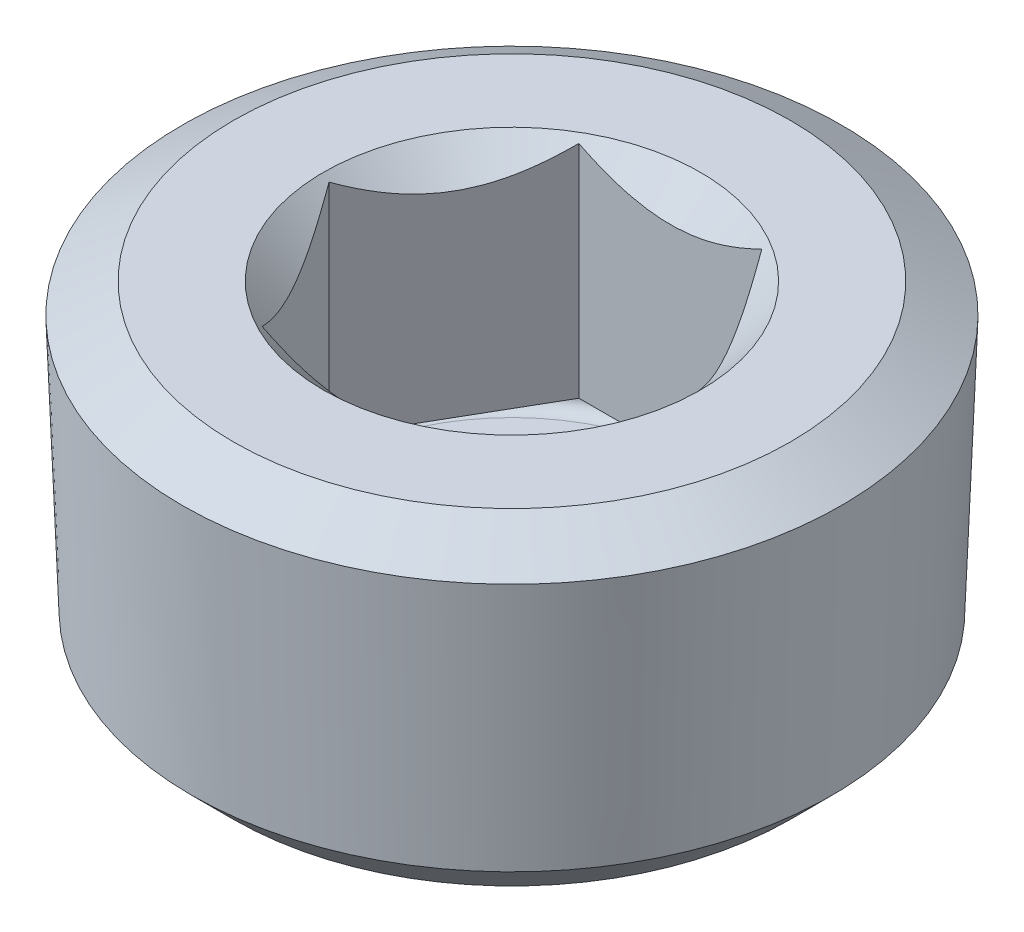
ISO-10303-21;
HEADER;
FILE_DESCRIPTION(('STEP AP214'),'2;1');
FILE_NAME('part.step','',(''),(''),'','','');
FILE_SCHEMA(('AUTOMOTIVE_DESIGN { 1 0 10303 214 1 1 1 1 }'));
ENDSEC;
DATA;
#1=APPLICATION_CONTEXT('core data for automotive mechanical design processes');
#2=APPLICATION_PROTOCOL_DEFINITION('international standard','automotive_design',2000,#1);
#3=PRODUCT_CONTEXT('',#1,'mechanical');
#4=PRODUCT('Part','Part','',(#3));
#5=PRODUCT_RELATED_PRODUCT_CATEGORY('part','',(#4));
#6=PRODUCT_DEFINITION_FORMATION('','',#4);
#7=PRODUCT_DEFINITION_CONTEXT('part definition',#1,'design');
#8=PRODUCT_DEFINITION('design','',#6,#7);
#9=PRODUCT_DEFINITION_SHAPE('','',#8);
#10=(LENGTH_UNIT() NAMED_UNIT(*) SI_UNIT(.MILLI.,.METRE.));
#11=(NAMED_UNIT(*) PLANE_ANGLE_UNIT() SI_UNIT($,.RADIAN.));
#12=(NAMED_UNIT(*) SI_UNIT($,.STERADIAN.) SOLID_ANGLE_UNIT());
#13=UNCERTAINTY_MEASURE_WITH_UNIT(LENGTH_MEASURE(1.E-05),#10,'distance_accuracy_value','');
#14=(GEOMETRIC_REPRESENTATION_CONTEXT(3) GLOBAL_UNCERTAINTY_ASSIGNED_CONTEXT((#13)) GLOBAL_UNIT_ASSIGNED_CONTEXT((#10,
#11,#12)) REPRESENTATION_CONTEXT('',''));
#15=CARTESIAN_POINT('',(0.,0.,0.));
#16=DIRECTION('',(0.,0.,1.));
#17=DIRECTION('',(1.,0.,0.));
#18=AXIS2_PLACEMENT_3D('',#15,#16,#17);
#19=CARTESIAN_POINT('',(0.,0.,0.));
#20=DIRECTION('',(0.,1.,0.));
#21=DIRECTION('',(0.,0.,1.));
#22=AXIS2_PLACEMENT_3D('',#19,#20,#21);
#23=PLANE('',#22);
#24=CARTESIAN_POINT('',(0.,0.,0.));
#25=DIRECTION('',(0.,1.,0.));
#26=DIRECTION('',(0.,0.,1.));
#27=AXIS2_PLACEMENT_3D('',#24,#25,#26);
#28=CIRCLE('',#27,9.525);
#29=CARTESIAN_POINT('',(0.,0.,9.525));
#30=VERTEX_POINT('',#29);
#31=EDGE_CURVE('E203',#30,#30,#28,.T.);
#32=ORIENTED_EDGE('',*,*,#31,.F.);
#33=EDGE_LOOP('',(#32));
#34=FACE_BOUND('',#33,.T.);
#35=CARTESIAN_POINT('',(0.,0.,0.));
#36=DIRECTION('',(0.,1.,0.));
#37=DIRECTION('',(0.,0.,1.));
#38=AXIS2_PLACEMENT_3D('',#35,#36,#37);
#39=CIRCLE('',#38,14.0665682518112);
#40=CARTESIAN_POINT('',(0.,0.,14.0665682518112));
#41=VERTEX_POINT('',#40);
#42=EDGE_CURVE('E95',#41,#41,#39,.T.);
#43=ORIENTED_EDGE('',*,*,#42,.T.);
#44=EDGE_LOOP('',(#43));
#45=FACE_BOUND('',#44,.T.);
#46=ADVANCED_FACE('F33',(#34,#45),#23,.T.);
#47=CARTESIAN_POINT('',(0.,0.,0.));
#48=DIRECTION('',(0.,-1.,0.));
#49=DIRECTION('',(0.,0.,-1.));
#50=AXIS2_PLACEMENT_3D('',#47,#48,#49);
#51=CONICAL_SURFACE('',#50,14.0665682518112,1.0471975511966);
#52=CARTESIAN_POINT('',(0.,-1.48935126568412,0.));
#53=DIRECTION('',(0.,1.,0.));
#54=DIRECTION('',(0.,0.,1.));
#55=AXIS2_PLACEMENT_3D('',#52,#53,#54);
#56=CIRCLE('',#55,16.6462003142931);
#57=CARTESIAN_POINT('',(0.,-1.48935126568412,16.6462003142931));
#58=VERTEX_POINT('',#57);
#59=EDGE_CURVE('E207',#58,#58,#56,.T.);
#60=ORIENTED_EDGE('',*,*,#59,.T.);
#61=EDGE_LOOP('',(#60));
#62=FACE_BOUND('',#61,.T.);
#63=ORIENTED_EDGE('',*,*,#42,.F.);
#64=EDGE_LOOP('',(#63));
#65=FACE_BOUND('',#64,.T.);
#66=ADVANCED_FACE('F193',(#62,#65),#51,.T.);
#67=CARTESIAN_POINT('',(0.,-1.48935126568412,0.));
#68=DIRECTION('',(0.,1.,0.));
#69=DIRECTION('',(0.,0.,1.));
#70=AXIS2_PLACEMENT_3D('',#67,#68,#69);
#71=CONICAL_SURFACE('',#70,16.6462003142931,0.0364424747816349);
#72=CARTESIAN_POINT('',(0.,-14.4011128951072,0.));
#73=DIRECTION('',(0.,1.,0.));
#74=DIRECTION('',(0.,0.,1.));
#75=AXIS2_PLACEMENT_3D('',#72,#73,#74);
#76=CIRCLE('',#75,16.1754553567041);
#77=CARTESIAN_POINT('',(0.,-14.4011128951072,16.1754553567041));
#78=VERTEX_POINT('',#77);
#79=EDGE_CURVE('E210',#78,#78,#76,.T.);
#80=ORIENTED_EDGE('',*,*,#79,.T.);
#81=EDGE_LOOP('',(#80));
#82=FACE_BOUND('',#81,.T.);
#83=ORIENTED_EDGE('',*,*,#59,.F.);
#84=EDGE_LOOP('',(#83));
#85=FACE_BOUND('',#84,.T.);
#86=ADVANCED_FACE('F198',(#82,#85),#71,.T.);
#87=CARTESIAN_POINT('',(0.,-14.4011128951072,0.));
#88=DIRECTION('',(0.,1.,0.));
#89=DIRECTION('',(0.,0.,1.));
#90=AXIS2_PLACEMENT_3D('',#87,#88,#89);
#91=CONICAL_SURFACE('',#90,16.1754553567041,0.785398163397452);
#92=CARTESIAN_POINT('',(0.,-16.51,0.));
#93=DIRECTION('',(0.,1.,0.));
#94=DIRECTION('',(0.,0.,1.));
#95=AXIS2_PLACEMENT_3D('',#92,#93,#94);
#96=CIRCLE('',#95,14.0665682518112);
#97=CARTESIAN_POINT('',(0.,-16.51,14.0665682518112));
#98=VERTEX_POINT('',#97);
#99=EDGE_CURVE('E215',#98,#98,#96,.T.);
#100=ORIENTED_EDGE('',*,*,#99,.T.);
#101=EDGE_LOOP('',(#100));
#102=FACE_BOUND('',#101,.T.);
#103=ORIENTED_EDGE('',*,*,#79,.F.);
#104=EDGE_LOOP('',(#103));
#105=FACE_BOUND('',#104,.T.);
#106=ADVANCED_FACE('F298',(#102,#105),#91,.T.);
#107=CARTESIAN_POINT('',(-14.0665682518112,-16.51,0.));
#108=DIRECTION('',(0.,-1.,0.));
#109=DIRECTION('',(0.,0.,-1.));
#110=AXIS2_PLACEMENT_3D('',#107,#108,#109);
#111=PLANE('',#110);
#112=ORIENTED_EDGE('',*,*,#99,.F.);
#113=EDGE_LOOP('',(#112));
#114=FACE_BOUND('',#113,.T.);
#115=ADVANCED_FACE('F146',(#114),#111,.T.);
#116=CARTESIAN_POINT('',(0.,0.,0.));
#117=DIRECTION('',(0.,1.,0.));
#118=DIRECTION('',(0.,0.,1.));
#119=AXIS2_PLACEMENT_3D('',#116,#117,#118);
#120=CONICAL_SURFACE('',#119,9.525,0.785398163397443);
#121=CARTESIAN_POINT('',(-9.75620633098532,3.09243091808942,8.001));
#122=CARTESIAN_POINT('',(-9.52094099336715,2.91055682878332,8.001));
#123=CARTESIAN_POINT('',(-9.28442126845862,2.73028010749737,8.001));
#124=CARTESIAN_POINT('',(-8.80835565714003,2.37365499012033,8.001));
#125=CARTESIAN_POINT('',(-8.56880907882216,2.19730751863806,8.001));
#126=CARTESIAN_POINT('',(-8.0844234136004,1.8480200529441,8.001));
#127=CARTESIAN_POINT('',(-7.83955777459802,1.67511676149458,8.001));
#128=CARTESIAN_POINT('',(-7.34577433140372,1.33521676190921,8.001));
#129=CARTESIAN_POINT('',(-7.0968568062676,1.16821964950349,8.001));
#130=CARTESIAN_POINT('',(-6.57791291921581,0.830846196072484,8.001));
#131=CARTESIAN_POINT('',(-6.30756757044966,0.660958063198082,8.001));
#132=CARTESIAN_POINT('',(-5.76052121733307,0.331566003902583,8.001));
#133=CARTESIAN_POINT('',(-5.4838191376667,0.172063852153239,8.001));
#134=CARTESIAN_POINT('',(-4.92395672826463,-0.133171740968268,8.001));
#135=CARTESIAN_POINT('',(-4.64081858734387,-0.278945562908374,8.001));
#136=CARTESIAN_POINT('',(-4.06646640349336,-0.553458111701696,8.001));
#137=CARTESIAN_POINT('',(-3.77525629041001,-0.682204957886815,8.001));
#138=CARTESIAN_POINT('',(-3.21459014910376,-0.905803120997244,8.001));
#139=CARTESIAN_POINT('',(-2.94599103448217,-1.00278136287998,8.001));
#140=CARTESIAN_POINT('',(-2.40185059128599,-1.17524738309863,8.001));
#141=CARTESIAN_POINT('',(-2.12630883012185,-1.25073381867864,8.001));
#142=CARTESIAN_POINT('',(-1.57478797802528,-1.37483041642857,8.001));
#143=CARTESIAN_POINT('',(-1.29892235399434,-1.42393631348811,8.001));
#144=CARTESIAN_POINT('',(-0.743636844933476,-1.49423018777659,8.001));
#145=CARTESIAN_POINT('',(-0.46421774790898,-1.51542424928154,8.001));
#146=CARTESIAN_POINT('',(0.0824654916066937,-1.52802781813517,8.001));
#147=CARTESIAN_POINT('',(0.349699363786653,-1.5207587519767,8.001));
#148=CARTESIAN_POINT('',(0.88213316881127,-1.47989810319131,8.001));
#149=CARTESIAN_POINT('',(1.14733291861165,-1.44630417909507,8.001));
#150=CARTESIAN_POINT('',(1.67827793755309,-1.35414026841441,8.001));
#151=CARTESIAN_POINT('',(1.94394456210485,-1.29512495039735,8.001));
#152=CARTESIAN_POINT('',(2.46940811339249,-1.15542669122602,8.001));
#153=CARTESIAN_POINT('',(2.72920532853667,-1.07474481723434,8.001));
#154=CARTESIAN_POINT('',(3.25501235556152,-0.890913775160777,8.001));
#155=CARTESIAN_POINT('',(3.52070069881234,-0.786855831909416,8.001));
#156=CARTESIAN_POINT('',(4.04525678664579,-0.562643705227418,8.001));
#157=CARTESIAN_POINT('',(4.30412141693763,-0.442482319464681,8.001));
#158=CARTESIAN_POINT('',(4.81624343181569,-0.188911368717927,8.001));
#159=CARTESIAN_POINT('',(5.06948054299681,-0.0554611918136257,8.001));
#160=CARTESIAN_POINT('',(5.57015704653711,0.221753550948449,8.001));
#161=CARTESIAN_POINT('',(5.81759731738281,0.365516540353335,8.001));
#162=CARTESIAN_POINT('',(6.29535628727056,0.654051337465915,8.001));
#163=CARTESIAN_POINT('',(6.52591752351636,0.798423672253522,8.001));
#164=CARTESIAN_POINT('',(6.98307831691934,1.09332822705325,8.001));
#165=CARTESIAN_POINT('',(7.20967757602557,1.24386090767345,8.001));
#166=CARTESIAN_POINT('',(7.65761461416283,1.5487666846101,8.001));
#167=CARTESIAN_POINT('',(7.87897999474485,1.7030993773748,8.001));
#168=CARTESIAN_POINT('',(8.31867170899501,2.01591299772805,8.001));
#169=CARTESIAN_POINT('',(8.53699886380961,2.17439276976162,8.001));
#170=CARTESIAN_POINT('',(8.75405107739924,2.33457045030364,8.001));
#171=B_SPLINE_CURVE_WITH_KNOTS('',3,(#121,#122,#123,#124,#125,#126,#127,#128,#129,#130,#131,
#132,#133,#134,#135,#136,#137,#138,#139,#140,#141,#142,#143,#144,#145,#146,#147,#148,#149,#150,
#151,#152,#153,#154,#155,#156,#157,#158,#159,#160,#161,#162,#163,#164,#165,#166,#167,#168,#169,
#170),.UNSPECIFIED.,.F.,.F.,(4,2,2,2,2,2,2,2,2,2,2,2,2,2,2,2,2,2,2,2,2,2,2,2,4),(0.,
0.892121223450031,1.784450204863,2.68365151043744,3.58279114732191,4.54048731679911,
5.4983467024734,6.45329436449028,7.40778500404,8.26376032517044,9.11978911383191,
9.95911277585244,10.7982534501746,11.5989086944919,12.3996351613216,13.2149987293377,
14.030322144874,14.885685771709,15.7414332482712,16.5998812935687,17.4581983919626,
18.274182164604,19.0902270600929,19.8997375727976,20.7090248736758),.UNSPECIFIED.);
#172=CARTESIAN_POINT('',(4.6193795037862,-0.286240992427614,8.001));
#173=VERTEX_POINT('',#172);
#174=CARTESIAN_POINT('',(-4.61937950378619,-0.286240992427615,8.001));
#175=VERTEX_POINT('',#174);
#176=EDGE_CURVE('E47',#173,#175,#171,.F.);
#177=ORIENTED_EDGE('',*,*,#176,.T.);
#178=CARTESIAN_POINT('',(-4.61926403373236,-0.28612552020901,8.0012));
#179=CARTESIAN_POINT('',(-4.69869011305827,-0.365542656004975,7.86362999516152));
#180=CARTESIAN_POINT('',(-4.77872669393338,-0.442522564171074,7.72500257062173));
#181=CARTESIAN_POINT('',(-4.94014062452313,-0.590866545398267,7.44542544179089));
#182=CARTESIAN_POINT('',(-5.02151867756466,-0.662227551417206,7.30447451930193));
#183=CARTESIAN_POINT('',(-5.2686006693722,-0.867378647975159,6.87651595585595));
#184=CARTESIAN_POINT('',(-5.43639624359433,-0.991361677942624,6.58588549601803));
#185=CARTESIAN_POINT('',(-5.77476940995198,-1.20367390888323,5.99980597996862));
#186=CARTESIAN_POINT('',(-5.94526052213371,-1.29253797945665,5.70450671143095));
#187=CARTESIAN_POINT('',(-6.2038000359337,-1.39533175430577,5.25670313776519));
#188=CARTESIAN_POINT('',(-6.29036050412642,-1.42449887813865,5.10677600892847));
#189=CARTESIAN_POINT('',(-6.46421433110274,-1.47200567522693,4.80565234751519));
#190=CARTESIAN_POINT('',(-6.55150757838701,-1.49034696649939,4.65445600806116));
#191=CARTESIAN_POINT('',(-6.7642309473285,-1.52109895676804,4.28600832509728));
#192=CARTESIAN_POINT('',(-6.88989027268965,-1.52755109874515,4.06835998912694));
#193=CARTESIAN_POINT('',(-7.14098242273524,-1.51672016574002,3.63345562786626));
#194=CARTESIAN_POINT('',(-7.26641515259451,-1.49942877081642,3.41619976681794));
#195=CARTESIAN_POINT('',(-7.51609803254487,-1.44213002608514,2.98373633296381));
#196=CARTESIAN_POINT('',(-7.64034670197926,-1.40209727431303,2.76853132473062));
#197=CARTESIAN_POINT('',(-7.88670850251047,-1.30149224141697,2.34182016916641));
#198=CARTESIAN_POINT('',(-8.00882179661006,-1.24092153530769,2.13031373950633));
#199=CARTESIAN_POINT('',(-8.22559130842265,-1.11631110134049,1.75485793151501));
#200=CARTESIAN_POINT('',(-8.32072758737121,-1.05554902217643,1.59007706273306));
#201=CARTESIAN_POINT('',(-8.5092923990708,-0.924233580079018,1.26347322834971));
#202=CARTESIAN_POINT('',(-8.60272088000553,-0.853679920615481,1.10165035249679));
#203=CARTESIAN_POINT('',(-8.78757582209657,-0.704362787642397,0.781472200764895));
#204=CARTESIAN_POINT('',(-8.87900754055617,-0.62562513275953,0.623107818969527));
#205=CARTESIAN_POINT('',(-9.06017798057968,-0.460973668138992,0.309311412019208));
#206=CARTESIAN_POINT('',(-9.14991769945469,-0.375064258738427,0.153877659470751));
#207=CARTESIAN_POINT('',(-9.23887447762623,-0.28612552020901,-0.000199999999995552));
#208=B_SPLINE_CURVE_WITH_KNOTS('',3,(#178,#179,#180,#181,#182,#183,#184,#185,#186,#187,#188,
#189,#190,#191,#192,#193,#194,#195,#196,#197,#198,#199,#200,#201,#202,#203,#204,#205,#206,#207),
.UNSPECIFIED.,.F.,.F.,(4,2,2,2,2,2,2,2,2,2,2,2,2,2,4),(0.,0.532763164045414,1.06581514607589,
2.13767380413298,3.1925129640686,3.71889809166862,4.24520452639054,4.99823705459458,
5.75153351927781,6.5056730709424,7.25975480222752,7.8586907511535,8.45764484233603,
9.05476364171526,9.6515187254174),.UNSPECIFIED.);
#209=CARTESIAN_POINT('',(-9.23875900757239,-0.286240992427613,0.));
#210=VERTEX_POINT('',#209);
#211=EDGE_CURVE('E101',#175,#210,#208,.T.);
#212=ORIENTED_EDGE('',*,*,#211,.T.);
#213=CARTESIAN_POINT('',(-9.23887447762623,-0.28612552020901,0.000200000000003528));
#214=CARTESIAN_POINT('',(-9.15944839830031,-0.365542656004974,-0.137370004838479));
#215=CARTESIAN_POINT('',(-9.0794118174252,-0.442522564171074,-0.275997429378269));
#216=CARTESIAN_POINT('',(-8.91799788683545,-0.590866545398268,-0.555574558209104));
#217=CARTESIAN_POINT('',(-8.83661983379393,-0.662227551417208,-0.696525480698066));
#218=CARTESIAN_POINT('',(-8.58953784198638,-0.867378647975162,-1.12448404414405));
#219=CARTESIAN_POINT('',(-8.42174226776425,-0.991361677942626,-1.41511450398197));
#220=CARTESIAN_POINT('',(-8.0833691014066,-1.20367390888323,-2.00119402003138));
#221=CARTESIAN_POINT('',(-7.91287798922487,-1.29253797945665,-2.29649328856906));
#222=CARTESIAN_POINT('',(-7.65433847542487,-1.39533175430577,-2.74429686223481));
#223=CARTESIAN_POINT('',(-7.56777800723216,-1.42449887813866,-2.89422399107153));
#224=CARTESIAN_POINT('',(-7.39392418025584,-1.47200567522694,-3.19534765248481));
#225=CARTESIAN_POINT('',(-7.30663093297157,-1.4903469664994,-3.34654399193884));
#226=CARTESIAN_POINT('',(-7.09390756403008,-1.52109895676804,-3.71499167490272));
#227=CARTESIAN_POINT('',(-6.96824823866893,-1.52755109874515,-3.93264001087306));
#228=CARTESIAN_POINT('',(-6.71715608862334,-1.51672016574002,-4.36754437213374));
#229=CARTESIAN_POINT('',(-6.59172335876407,-1.49942877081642,-4.58480023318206));
#230=CARTESIAN_POINT('',(-6.34204047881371,-1.44213002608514,-5.01726366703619));
#231=CARTESIAN_POINT('',(-6.21779180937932,-1.40209727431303,-5.23246867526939));
#232=CARTESIAN_POINT('',(-5.97143000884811,-1.30149224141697,-5.6591798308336));
#233=CARTESIAN_POINT('',(-5.84931671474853,-1.24092153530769,-5.87068626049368));
#234=CARTESIAN_POINT('',(-5.63254720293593,-1.11631110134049,-6.246142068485));
#235=CARTESIAN_POINT('',(-5.53741092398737,-1.05554902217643,-6.41092293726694));
#236=CARTESIAN_POINT('',(-5.34884611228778,-0.924233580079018,-6.73752677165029));
#237=CARTESIAN_POINT('',(-5.25541763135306,-0.853679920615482,-6.89934964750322));
#238=CARTESIAN_POINT('',(-5.07056268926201,-0.704362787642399,-7.21952779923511));
#239=CARTESIAN_POINT('',(-4.97913097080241,-0.625625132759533,-7.37789218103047));
#240=CARTESIAN_POINT('',(-4.7979605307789,-0.460973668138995,-7.69168858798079));
#241=CARTESIAN_POINT('',(-4.7082208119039,-0.37506425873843,-7.84712234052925));
#242=CARTESIAN_POINT('',(-4.61926403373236,-0.286125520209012,-8.0012));
#243=B_SPLINE_CURVE_WITH_KNOTS('',3,(#213,#214,#215,#216,#217,#218,#219,#220,#221,#222,#223,
#224,#225,#226,#227,#228,#229,#230,#231,#232,#233,#234,#235,#236,#237,#238,#239,#240,#241,#242),
.UNSPECIFIED.,.F.,.F.,(4,2,2,2,2,2,2,2,2,2,2,2,2,2,4),(0.,0.532763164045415,1.06581514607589,
2.13767380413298,3.19251296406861,3.71889809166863,4.24520452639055,4.99823705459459,
5.75153351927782,6.50567307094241,7.25975480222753,7.85869075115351,8.45764484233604,
9.05476364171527,9.65151872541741),.UNSPECIFIED.);
#244=CARTESIAN_POINT('',(-4.6193795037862,-0.286240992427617,-8.00099999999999));
#245=VERTEX_POINT('',#244);
#246=EDGE_CURVE('E167',#210,#245,#243,.T.);
#247=ORIENTED_EDGE('',*,*,#246,.T.);
#248=CARTESIAN_POINT('',(-9.75620633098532,3.09243091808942,-8.00099999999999));
#249=CARTESIAN_POINT('',(-9.52094099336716,2.91055682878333,-8.00099999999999));
#250=CARTESIAN_POINT('',(-9.28442126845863,2.73028010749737,-8.00099999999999));
#251=CARTESIAN_POINT('',(-8.80835565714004,2.37365499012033,-8.00099999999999));
#252=CARTESIAN_POINT('',(-8.56880907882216,2.19730751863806,-8.00099999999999));
#253=CARTESIAN_POINT('',(-8.08442341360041,1.8480200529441,-8.00099999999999));
#254=CARTESIAN_POINT('',(-7.83955777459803,1.67511676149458,-8.00099999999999));
#255=CARTESIAN_POINT('',(-7.34577433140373,1.33521676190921,-8.00099999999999));
#256=CARTESIAN_POINT('',(-7.0968568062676,1.16821964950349,-8.00099999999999));
#257=CARTESIAN_POINT('',(-6.57791291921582,0.830846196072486,-8.00099999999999));
#258=CARTESIAN_POINT('',(-6.30756757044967,0.660958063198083,-8.00099999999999));
#259=CARTESIAN_POINT('',(-5.76052121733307,0.331566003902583,-8.00099999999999));
#260=CARTESIAN_POINT('',(-5.4838191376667,0.172063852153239,-8.00099999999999));
#261=CARTESIAN_POINT('',(-4.92395672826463,-0.133171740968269,-8.00099999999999));
#262=CARTESIAN_POINT('',(-4.64081858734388,-0.278945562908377,-8.00099999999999));
#263=CARTESIAN_POINT('',(-4.06646640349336,-0.5534581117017,-8.00099999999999));
#264=CARTESIAN_POINT('',(-3.77525629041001,-0.682204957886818,-8.00099999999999));
#265=CARTESIAN_POINT('',(-3.21459014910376,-0.905803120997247,-8.00099999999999));
#266=CARTESIAN_POINT('',(-2.94599103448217,-1.00278136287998,-8.00099999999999));
#267=CARTESIAN_POINT('',(-2.40185059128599,-1.17524738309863,-8.00099999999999));
#268=CARTESIAN_POINT('',(-2.12630883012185,-1.25073381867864,-8.00099999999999));
#269=CARTESIAN_POINT('',(-1.57478797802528,-1.37483041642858,-8.00099999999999));
#270=CARTESIAN_POINT('',(-1.29892235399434,-1.42393631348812,-8.00099999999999));
#271=CARTESIAN_POINT('',(-0.743636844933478,-1.49423018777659,-8.00099999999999));
#272=CARTESIAN_POINT('',(-0.464217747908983,-1.51542424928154,-8.00099999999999));
#273=CARTESIAN_POINT('',(0.0824654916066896,-1.52802781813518,-8.00099999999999));
#274=CARTESIAN_POINT('',(0.349699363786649,-1.5207587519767,-8.00099999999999));
#275=CARTESIAN_POINT('',(0.882133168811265,-1.47989810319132,-8.00099999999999));
#276=CARTESIAN_POINT('',(1.14733291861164,-1.44630417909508,-8.00099999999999));
#277=CARTESIAN_POINT('',(1.67827793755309,-1.35414026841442,-8.00099999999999));
#278=CARTESIAN_POINT('',(1.94394456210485,-1.29512495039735,-8.00099999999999));
#279=CARTESIAN_POINT('',(2.46940811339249,-1.15542669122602,-8.00099999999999));
#280=CARTESIAN_POINT('',(2.72920532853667,-1.07474481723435,-8.00099999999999));
#281=CARTESIAN_POINT('',(3.25501235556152,-0.89091377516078,-8.00099999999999));
#282=CARTESIAN_POINT('',(3.52070069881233,-0.78685583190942,-8.00099999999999));
#283=CARTESIAN_POINT('',(4.04525678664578,-0.562643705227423,-8.00099999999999));
#284=CARTESIAN_POINT('',(4.30412141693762,-0.442482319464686,-8.00099999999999));
#285=CARTESIAN_POINT('',(4.81624343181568,-0.188911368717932,-8.00099999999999));
#286=CARTESIAN_POINT('',(5.06948054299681,-0.0554611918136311,-8.00099999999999));
#287=CARTESIAN_POINT('',(5.5701570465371,0.221753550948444,-8.00099999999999));
#288=CARTESIAN_POINT('',(5.81759731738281,0.365516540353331,-8.00099999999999));
#289=CARTESIAN_POINT('',(6.29535628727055,0.654051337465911,-8.00099999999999));
#290=CARTESIAN_POINT('',(6.52591752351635,0.798423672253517,-8.00099999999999));
#291=CARTESIAN_POINT('',(6.98307831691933,1.09332822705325,-8.00099999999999));
#292=CARTESIAN_POINT('',(7.20967757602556,1.24386090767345,-8.00099999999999));
#293=CARTESIAN_POINT('',(7.65761461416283,1.5487666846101,-8.00099999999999));
#294=CARTESIAN_POINT('',(7.87897999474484,1.70309937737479,-8.00099999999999));
#295=CARTESIAN_POINT('',(8.31867170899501,2.01591299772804,-8.00099999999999));
#296=CARTESIAN_POINT('',(8.5369988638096,2.17439276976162,-8.00099999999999));
#297=CARTESIAN_POINT('',(8.75405107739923,2.33457045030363,-8.00099999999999));
#298=B_SPLINE_CURVE_WITH_KNOTS('',3,(#248,#249,#250,#251,#252,#253,#254,#255,#256,#257,#258,
#259,#260,#261,#262,#263,#264,#265,#266,#267,#268,#269,#270,#271,#272,#273,#274,#275,#276,#277,
#278,#279,#280,#281,#282,#283,#284,#285,#286,#287,#288,#289,#290,#291,#292,#293,#294,#295,#296,
#297),.UNSPECIFIED.,.F.,.F.,(4,2,2,2,2,2,2,2,2,2,2,2,2,2,2,2,2,2,2,2,2,2,2,2,4),(0.,
0.892121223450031,1.784450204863,2.68365151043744,3.58279114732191,4.54048731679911,
5.49834670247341,6.45329436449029,7.40778500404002,8.26376032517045,9.11978911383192,
9.95911277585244,10.7982534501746,11.5989086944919,12.3996351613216,13.2149987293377,
14.030322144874,14.885685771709,15.7414332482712,16.5998812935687,17.4581983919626,
18.274182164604,19.0902270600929,19.8997375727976,20.7090248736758),.UNSPECIFIED.);
#299=CARTESIAN_POINT('',(4.61937950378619,-0.286240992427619,-8.00099999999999));
#300=VERTEX_POINT('',#299);
#301=EDGE_CURVE('E161',#245,#300,#298,.T.);
#302=ORIENTED_EDGE('',*,*,#301,.T.);
#303=CARTESIAN_POINT('',(4.61926403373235,-0.286125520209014,-8.0012));
#304=CARTESIAN_POINT('',(4.69869011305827,-0.365542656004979,-7.86362999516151));
#305=CARTESIAN_POINT('',(4.77872669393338,-0.442522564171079,-7.72500257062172));
#306=CARTESIAN_POINT('',(4.94014062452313,-0.590866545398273,-7.44542544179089));
#307=CARTESIAN_POINT('',(5.02151867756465,-0.662227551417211,-7.30447451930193));
#308=CARTESIAN_POINT('',(5.2686006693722,-0.867378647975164,-6.87651595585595));
#309=CARTESIAN_POINT('',(5.43639624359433,-0.991361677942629,-6.58588549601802));
#310=CARTESIAN_POINT('',(5.77476940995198,-1.20367390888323,-5.99980597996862));
#311=CARTESIAN_POINT('',(5.9452605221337,-1.29253797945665,-5.70450671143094));
#312=CARTESIAN_POINT('',(6.2038000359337,-1.39533175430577,-5.25670313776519));
#313=CARTESIAN_POINT('',(6.29036050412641,-1.42449887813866,-5.10677600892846));
#314=CARTESIAN_POINT('',(6.46421433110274,-1.47200567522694,-4.80565234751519));
#315=CARTESIAN_POINT('',(6.551507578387,-1.4903469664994,-4.65445600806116));
#316=CARTESIAN_POINT('',(6.76423094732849,-1.52109895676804,-4.28600832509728));
#317=CARTESIAN_POINT('',(6.88989027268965,-1.52755109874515,-4.06835998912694));
#318=CARTESIAN_POINT('',(7.14098242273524,-1.51672016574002,-3.63345562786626));
#319=CARTESIAN_POINT('',(7.26641515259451,-1.49942877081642,-3.41619976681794));
#320=CARTESIAN_POINT('',(7.51609803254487,-1.44213002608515,-2.98373633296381));
#321=CARTESIAN_POINT('',(7.64034670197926,-1.40209727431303,-2.76853132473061));
#322=CARTESIAN_POINT('',(7.88670850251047,-1.30149224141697,-2.3418201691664));
#323=CARTESIAN_POINT('',(8.00882179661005,-1.24092153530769,-2.13031373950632));
#324=CARTESIAN_POINT('',(8.22559130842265,-1.11631110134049,-1.75485793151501));
#325=CARTESIAN_POINT('',(8.32072758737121,-1.05554902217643,-1.59007706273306));
#326=CARTESIAN_POINT('',(8.5092923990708,-0.92423358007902,-1.26347322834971));
#327=CARTESIAN_POINT('',(8.60272088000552,-0.853679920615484,-1.10165035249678));
#328=CARTESIAN_POINT('',(8.78757582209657,-0.704362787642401,-0.781472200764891));
#329=CARTESIAN_POINT('',(8.87900754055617,-0.625625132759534,-0.623107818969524));
#330=CARTESIAN_POINT('',(9.06017798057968,-0.460973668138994,-0.309311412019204));
#331=CARTESIAN_POINT('',(9.14991769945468,-0.375064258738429,-0.153877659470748));
#332=CARTESIAN_POINT('',(9.23887447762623,-0.28612552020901,0.000199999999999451));
#333=B_SPLINE_CURVE_WITH_KNOTS('',3,(#303,#304,#305,#306,#307,#308,#309,#310,#311,#312,#313,
#314,#315,#316,#317,#318,#319,#320,#321,#322,#323,#324,#325,#326,#327,#328,#329,#330,#331,#332),
.UNSPECIFIED.,.F.,.F.,(4,2,2,2,2,2,2,2,2,2,2,2,2,2,4),(0.,0.532763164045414,1.06581514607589,
2.13767380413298,3.19251296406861,3.71889809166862,4.24520452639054,4.99823705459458,
5.75153351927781,6.5056730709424,7.25975480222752,7.8586907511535,8.45764484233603,
9.05476364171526,9.6515187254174),.UNSPECIFIED.);
#334=CARTESIAN_POINT('',(9.23875900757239,-0.286240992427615,0.));
#335=VERTEX_POINT('',#334);
#336=EDGE_CURVE('E155',#300,#335,#333,.T.);
#337=ORIENTED_EDGE('',*,*,#336,.T.);
#338=CARTESIAN_POINT('',(9.23887447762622,-0.286125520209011,-0.000200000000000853));
#339=CARTESIAN_POINT('',(9.15944839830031,-0.365542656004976,0.137370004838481));
#340=CARTESIAN_POINT('',(9.0794118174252,-0.442522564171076,0.275997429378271));
#341=CARTESIAN_POINT('',(8.91799788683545,-0.59086654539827,0.555574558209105));
#342=CARTESIAN_POINT('',(8.83661983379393,-0.662227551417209,0.696525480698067));
#343=CARTESIAN_POINT('',(8.58953784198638,-0.867378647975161,1.12448404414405));
#344=CARTESIAN_POINT('',(8.42174226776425,-0.991361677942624,1.41511450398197));
#345=CARTESIAN_POINT('',(8.0833691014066,-1.20367390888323,2.00119402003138));
#346=CARTESIAN_POINT('',(7.91287798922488,-1.29253797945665,2.29649328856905));
#347=CARTESIAN_POINT('',(7.65433847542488,-1.39533175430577,2.7442968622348));
#348=CARTESIAN_POINT('',(7.56777800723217,-1.42449887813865,2.89422399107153));
#349=CARTESIAN_POINT('',(7.39392418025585,-1.47200567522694,3.19534765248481));
#350=CARTESIAN_POINT('',(7.30663093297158,-1.49034696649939,3.34654399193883));
#351=CARTESIAN_POINT('',(7.09390756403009,-1.52109895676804,3.71499167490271));
#352=CARTESIAN_POINT('',(6.96824823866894,-1.52755109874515,3.93264001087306));
#353=CARTESIAN_POINT('',(6.71715608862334,-1.51672016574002,4.36754437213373));
#354=CARTESIAN_POINT('',(6.59172335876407,-1.49942877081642,4.58480023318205));
#355=CARTESIAN_POINT('',(6.34204047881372,-1.44213002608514,5.01726366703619));
#356=CARTESIAN_POINT('',(6.21779180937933,-1.40209727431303,5.23246867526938));
#357=CARTESIAN_POINT('',(5.97143000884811,-1.30149224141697,5.65917983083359));
#358=CARTESIAN_POINT('',(5.84931671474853,-1.24092153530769,5.87068626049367));
#359=CARTESIAN_POINT('',(5.63254720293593,-1.11631110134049,6.24614206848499));
#360=CARTESIAN_POINT('',(5.53741092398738,-1.05554902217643,6.41092293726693));
#361=CARTESIAN_POINT('',(5.34884611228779,-0.924233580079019,6.73752677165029));
#362=CARTESIAN_POINT('',(5.25541763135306,-0.853679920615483,6.89934964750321));
#363=CARTESIAN_POINT('',(5.07056268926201,-0.704362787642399,7.21952779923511));
#364=CARTESIAN_POINT('',(4.97913097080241,-0.625625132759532,7.37789218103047));
#365=CARTESIAN_POINT('',(4.79796053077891,-0.460973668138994,7.69168858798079));
#366=CARTESIAN_POINT('',(4.7082208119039,-0.375064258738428,7.84712234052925));
#367=CARTESIAN_POINT('',(4.61926403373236,-0.28612552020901,8.0012));
#368=B_SPLINE_CURVE_WITH_KNOTS('',3,(#338,#339,#340,#341,#342,#343,#344,#345,#346,#347,#348,
#349,#350,#351,#352,#353,#354,#355,#356,#357,#358,#359,#360,#361,#362,#363,#364,#365,#366,#367),
.UNSPECIFIED.,.F.,.F.,(4,2,2,2,2,2,2,2,2,2,2,2,2,2,4),(0.,0.532763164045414,1.06581514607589,
2.13767380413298,3.1925129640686,3.71889809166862,4.24520452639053,4.99823705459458,
5.75153351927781,6.5056730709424,7.25975480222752,7.8586907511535,8.45764484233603,
9.05476364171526,9.65151872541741),.UNSPECIFIED.);
#369=EDGE_CURVE('E120',#335,#173,#368,.T.);
#370=ORIENTED_EDGE('',*,*,#369,.T.);
#371=EDGE_LOOP('',(#177,#212,#247,#302,#337,#370));
#372=FACE_BOUND('',#371,.T.);
#373=ORIENTED_EDGE('',*,*,#31,.T.);
#374=EDGE_LOOP('',(#373));
#375=FACE_BOUND('',#374,.T.);
#376=ADVANCED_FACE('F141',(#372,#375),#120,.F.);
#377=CARTESIAN_POINT('',(-9.23875900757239,-11.43,0.));
#378=DIRECTION('',(-0.866025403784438,0.,0.5));
#379=DIRECTION('',(0.5,0.,0.866025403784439));
#380=AXIS2_PLACEMENT_3D('',#377,#378,#379);
#381=PLANE('',#380);
#382=DIRECTION('',(0.,1.,0.));
#383=VECTOR('',#382,1.);
#384=CARTESIAN_POINT('',(-4.61937950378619,-11.43,8.001));
#385=LINE('',#384,#383);
#386=CARTESIAN_POINT('',(-4.61937950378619,-11.43,8.001));
#387=VERTEX_POINT('',#386);
#388=EDGE_CURVE('E89',#387,#175,#385,.T.);
#389=ORIENTED_EDGE('',*,*,#388,.F.);
#390=DIRECTION('',(0.5,0.,0.866025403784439));
#391=VECTOR('',#390,1.);
#392=CARTESIAN_POINT('',(-8.92931925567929,-11.43,0.535965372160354));
#393=LINE('',#392,#391);
#394=CARTESIAN_POINT('',(-9.23875900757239,-11.43,0.));
#395=VERTEX_POINT('',#394);
#396=EDGE_CURVE('E94',#395,#387,#393,.T.);
#397=ORIENTED_EDGE('',*,*,#396,.F.);
#398=DIRECTION('',(0.,1.,0.));
#399=VECTOR('',#398,1.);
#400=CARTESIAN_POINT('',(-9.23875900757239,-11.43,0.));
#401=LINE('',#400,#399);
#402=EDGE_CURVE('E133',#395,#210,#401,.T.);
#403=ORIENTED_EDGE('',*,*,#402,.T.);
#404=ORIENTED_EDGE('',*,*,#211,.F.);
#405=EDGE_LOOP('',(#389,#397,#403,#404));
#406=FACE_BOUND('',#405,.T.);
#407=ADVANCED_FACE('F98',(#406),#381,.F.);
#408=CARTESIAN_POINT('',(-4.6193795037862,-11.43,-8.00099999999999));
#409=DIRECTION('',(-0.866025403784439,0.,-0.5));
#410=DIRECTION('',(-0.5,0.,0.866025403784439));
#411=AXIS2_PLACEMENT_3D('',#408,#409,#410);
#412=PLANE('',#411);
#413=ORIENTED_EDGE('',*,*,#402,.F.);
#414=DIRECTION('',(-0.5,0.,0.866025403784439));
#415=VECTOR('',#414,1.);
#416=CARTESIAN_POINT('',(-8.92931925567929,-11.43,-0.535965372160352));
#417=LINE('',#416,#415);
#418=CARTESIAN_POINT('',(-4.6193795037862,-11.43,-8.00099999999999));
#419=VERTEX_POINT('',#418);
#420=EDGE_CURVE('E106',#419,#395,#417,.T.);
#421=ORIENTED_EDGE('',*,*,#420,.F.);
#422=DIRECTION('',(0.,1.,0.));
#423=VECTOR('',#422,1.);
#424=CARTESIAN_POINT('',(-4.6193795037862,-11.43,-8.00099999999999));
#425=LINE('',#424,#423);
#426=EDGE_CURVE('E122',#419,#245,#425,.T.);
#427=ORIENTED_EDGE('',*,*,#426,.T.);
#428=ORIENTED_EDGE('',*,*,#246,.F.);
#429=EDGE_LOOP('',(#413,#421,#427,#428));
#430=FACE_BOUND('',#429,.T.);
#431=ADVANCED_FACE('F176',(#430),#412,.F.);
#432=CARTESIAN_POINT('',(4.61937950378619,-11.43,-8.00099999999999));
#433=DIRECTION('',(0.,0.,-1.));
#434=DIRECTION('',(-1.,0.,0.));
#435=AXIS2_PLACEMENT_3D('',#432,#433,#434);
#436=PLANE('',#435);
#437=ORIENTED_EDGE('',*,*,#426,.F.);
#438=DIRECTION('',(-1.,0.,0.));
#439=VECTOR('',#438,1.);
#440=CARTESIAN_POINT('',(-8.001,-11.43,-8.00099999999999));
#441=LINE('',#440,#439);
#442=CARTESIAN_POINT('',(4.61937950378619,-11.43,-8.00099999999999));
#443=VERTEX_POINT('',#442);
#444=EDGE_CURVE('E12',#443,#419,#441,.T.);
#445=ORIENTED_EDGE('',*,*,#444,.F.);
#446=DIRECTION('',(0.,1.,0.));
#447=VECTOR('',#446,1.);
#448=CARTESIAN_POINT('',(4.61937950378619,-11.43,-8.00099999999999));
#449=LINE('',#448,#447);
#450=EDGE_CURVE('E117',#443,#300,#449,.T.);
#451=ORIENTED_EDGE('',*,*,#450,.T.);
#452=ORIENTED_EDGE('',*,*,#301,.F.);
#453=EDGE_LOOP('',(#437,#445,#451,#452));
#454=FACE_BOUND('',#453,.T.);
#455=ADVANCED_FACE('F179',(#454),#436,.F.);
#456=CARTESIAN_POINT('',(9.23875900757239,-11.43,0.));
#457=DIRECTION('',(0.866025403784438,0.,-0.5));
#458=DIRECTION('',(-0.5,0.,-0.866025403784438));
#459=AXIS2_PLACEMENT_3D('',#456,#457,#458);
#460=PLANE('',#459);
#461=ORIENTED_EDGE('',*,*,#450,.F.);
#462=DIRECTION('',(-0.5,0.,-0.866025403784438));
#463=VECTOR('',#462,1.);
#464=CARTESIAN_POINT('',(4.92881925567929,-11.43,-7.46503462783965));
#465=LINE('',#464,#463);
#466=CARTESIAN_POINT('',(9.23875900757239,-11.43,0.));
#467=VERTEX_POINT('',#466);
#468=EDGE_CURVE('E40',#467,#443,#465,.T.);
#469=ORIENTED_EDGE('',*,*,#468,.F.);
#470=DIRECTION('',(0.,1.,0.));
#471=VECTOR('',#470,1.);
#472=CARTESIAN_POINT('',(9.23875900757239,-11.43,0.));
#473=LINE('',#472,#471);
#474=EDGE_CURVE('E115',#467,#335,#473,.T.);
#475=ORIENTED_EDGE('',*,*,#474,.T.);
#476=ORIENTED_EDGE('',*,*,#336,.F.);
#477=EDGE_LOOP('',(#461,#469,#475,#476));
#478=FACE_BOUND('',#477,.T.);
#479=ADVANCED_FACE('F113',(#478),#460,.F.);
#480=CARTESIAN_POINT('',(4.6193795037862,-11.43,8.001));
#481=DIRECTION('',(0.866025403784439,0.,0.5));
#482=DIRECTION('',(0.5,0.,-0.866025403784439));
#483=AXIS2_PLACEMENT_3D('',#480,#481,#482);
#484=PLANE('',#483);
#485=ORIENTED_EDGE('',*,*,#474,.F.);
#486=DIRECTION('',(0.5,0.,-0.866025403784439));
#487=VECTOR('',#486,1.);
#488=CARTESIAN_POINT('',(4.92881925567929,-11.43,7.46503462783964));
#489=LINE('',#488,#487);
#490=CARTESIAN_POINT('',(4.6193795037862,-11.43,8.001));
#491=VERTEX_POINT('',#490);
#492=EDGE_CURVE('E55',#491,#467,#489,.T.);
#493=ORIENTED_EDGE('',*,*,#492,.F.);
#494=DIRECTION('',(0.,1.,0.));
#495=VECTOR('',#494,1.);
#496=CARTESIAN_POINT('',(4.6193795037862,-11.43,8.001));
#497=LINE('',#496,#495);
#498=EDGE_CURVE('E91',#491,#173,#497,.T.);
#499=ORIENTED_EDGE('',*,*,#498,.T.);
#500=ORIENTED_EDGE('',*,*,#369,.F.);
#501=EDGE_LOOP('',(#485,#493,#499,#500));
#502=FACE_BOUND('',#501,.T.);
#503=ADVANCED_FACE('F119',(#502),#484,.F.);
#504=CARTESIAN_POINT('',(-4.61937950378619,-11.43,8.001));
#505=DIRECTION('',(0.,0.,1.));
#506=DIRECTION('',(1.,0.,0.));
#507=AXIS2_PLACEMENT_3D('',#504,#505,#506);
#508=PLANE('',#507);
#509=ORIENTED_EDGE('',*,*,#498,.F.);
#510=DIRECTION('',(1.,0.,0.));
#511=VECTOR('',#510,1.);
#512=CARTESIAN_POINT('',(-8.001,-11.43,8.001));
#513=LINE('',#512,#511);
#514=EDGE_CURVE('E86',#387,#491,#513,.T.);
#515=ORIENTED_EDGE('',*,*,#514,.F.);
#516=ORIENTED_EDGE('',*,*,#388,.T.);
#517=ORIENTED_EDGE('',*,*,#176,.F.);
#518=EDGE_LOOP('',(#509,#515,#516,#517));
#519=FACE_BOUND('',#518,.T.);
#520=ADVANCED_FACE('F88',(#519),#508,.F.);
#521=CARTESIAN_POINT('',(-9.525,-12.7,0.));
#522=DIRECTION('',(0.,-1.,0.));
#523=DIRECTION('',(0.,0.,-1.));
#524=AXIS2_PLACEMENT_3D('',#521,#522,#523);
#525=PLANE('',#524);
#526=CARTESIAN_POINT('',(0.,-12.7,0.));
#527=DIRECTION('',(0.,1.,0.));
#528=DIRECTION('',(0.,0.,1.));
#529=AXIS2_PLACEMENT_3D('',#526,#527,#528);
#530=CIRCLE('',#529,9.525);
#531=CARTESIAN_POINT('',(0.,-12.7,9.525));
#532=VERTEX_POINT('',#531);
#533=EDGE_CURVE('E221',#532,#532,#530,.T.);
#534=ORIENTED_EDGE('',*,*,#533,.T.);
#535=EDGE_LOOP('',(#534));
#536=FACE_BOUND('',#535,.T.);
#537=ADVANCED_FACE('F191',(#536),#525,.F.);
#538=CARTESIAN_POINT('',(0.,-12.065,0.));
#539=DIRECTION('',(0.,1.,0.));
#540=DIRECTION('',(0.,0.,1.));
#541=AXIS2_PLACEMENT_3D('',#538,#539,#540);
#542=TOROIDAL_SURFACE('',#541,9.525,0.634999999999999);
#543=ORIENTED_EDGE('',*,*,#533,.F.);
#544=EDGE_LOOP('',(#543));
#545=FACE_BOUND('',#544,.T.);
#546=CARTESIAN_POINT('',(0.,-11.43,0.));
#547=DIRECTION('',(0.,1.,0.));
#548=DIRECTION('',(0.,0.,1.));
#549=AXIS2_PLACEMENT_3D('',#546,#547,#548);
#550=CIRCLE('',#549,9.525);
#551=CARTESIAN_POINT('',(0.,-11.43,9.525));
#552=VERTEX_POINT('',#551);
#553=EDGE_CURVE('E219',#552,#552,#550,.T.);
#554=ORIENTED_EDGE('',*,*,#553,.T.);
#555=EDGE_LOOP('',(#554));
#556=FACE_BOUND('',#555,.T.);
#557=ADVANCED_FACE('F232',(#545,#556),#542,.F.);
#558=CARTESIAN_POINT('',(-8.001,-11.43,0.));
#559=DIRECTION('',(0.,1.,0.));
#560=DIRECTION('',(0.,0.,1.));
#561=AXIS2_PLACEMENT_3D('',#558,#559,#560);
#562=PLANE('',#561);
#563=ORIENTED_EDGE('',*,*,#553,.F.);
#564=EDGE_LOOP('',(#563));
#565=FACE_BOUND('',#564,.T.);
#566=ORIENTED_EDGE('',*,*,#468,.T.);
#567=ORIENTED_EDGE('',*,*,#444,.T.);
#568=ORIENTED_EDGE('',*,*,#420,.T.);
#569=ORIENTED_EDGE('',*,*,#396,.T.);
#570=ORIENTED_EDGE('',*,*,#514,.T.);
#571=ORIENTED_EDGE('',*,*,#492,.T.);
#572=EDGE_LOOP('',(#566,#567,#568,#569,#570,#571));
#573=FACE_BOUND('',#572,.T.);
#574=ADVANCED_FACE('F105',(#565,#573),#562,.F.);
#575=CLOSED_SHELL('',(#46,#66,#86,#106,#115,#376,#407,#431,#455,#479,#503,#520,#537,#557,#574));
#576=MANIFOLD_SOLID_BREP('B2',#575);
#577=ADVANCED_BREP_SHAPE_REPRESENTATION('',(#18,#576),#14);
#578=SHAPE_DEFINITION_REPRESENTATION(#9,#577);
ENDSEC;
END-ISO-10303-21;
